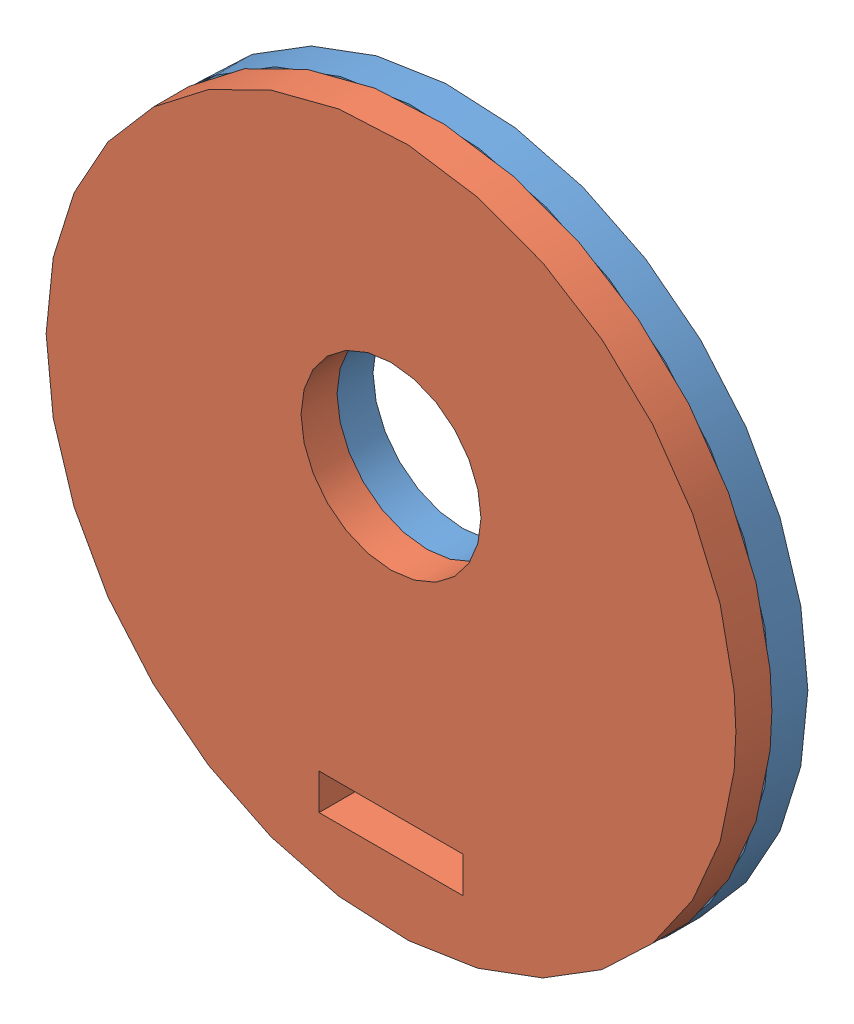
SolidWorks assembly Assem1.sldasm, configuration Default (file format 3100). Lengths in mm.
Overall size (73.03 73.03 7.62).
2 component instances, 2 part files, 2 mates.
Components (placement in the parent):
- LargeCouplerBulkhead2-1: LargeCouplerBulkhead2.SLDPRT [Default] at (-12.9986 9.4729 2.3285) size (73.03 73.03 3.81)
- LargeCouplerBulkhead1-1: LargeCouplerBulkhead1.SLDPRT [Default] at (-12.9986 9.4729 2.3285) size (73.03 73.03 3.81)
Mates (geometry in assembly coordinates):
- Concentric1: concentric aligned: circle of LargeCouplerBulkhead2-1 centre (-12.9986 9.4729 2.3285) axis (0 0 1); circle of LargeCouplerBulkhead1-1 centre (-12.9986 9.4729 6.1385) axis (0 0 1)
- Coincident2: coincident anti-aligned: plane of LargeCouplerBulkhead2-1 through (-12.9986 9.4729 2.3285) normal (0 0 1); plane of LargeCouplerBulkhead1-1 through (-12.9986 9.4729 2.3285) normal (0 0 -1)
